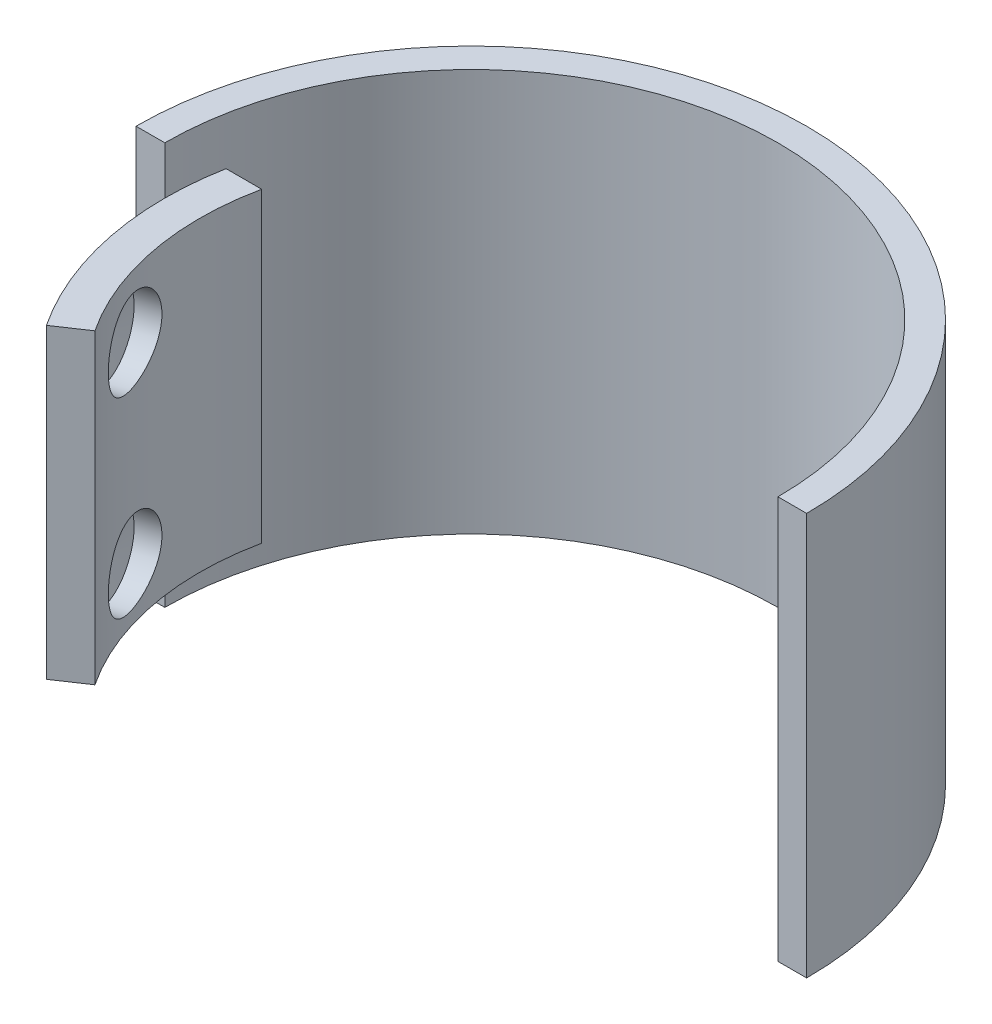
from build123d import *

# Parameters (mm, degrees)
BOSS_EXTRU_1_DEPTH              = 42
D_GAGEMENT_M102_D               = 8.5
D_GAGEMENT_M102_DEPTH           = 2
D_GAGEMENT_M102_TIP             = 0.559523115
D_GAGEMENT_M102_ON_FACE_2_D     = 8.5
D_GAGEMENT_M102_ON_FACE_2_DEPTH = 2
D_GAGEMENT_M102_ON_FACE_2_TIP   = 0.559523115
ENL_V_START                     = -5
ENL_V_MAT_EXTRU_1_DEPTH         = 5
ENL_V_MAT_EXTRU_2_DEPTH         = 5
D_GAGEMENT_M103_D               = 8.5
D_GAGEMENT_M103_DEPTH           = 2
D_GAGEMENT_M103_TIP             = 0.559523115
D_GAGEMENT_M103_ON_FACE_2_D     = 8.5
D_GAGEMENT_M103_ON_FACE_2_DEPTH = 2
D_GAGEMENT_M103_ON_FACE_2_TIP   = 0.559523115


with BuildPart() as part:
    # Esquisse1 → Boss.-Extru.1 (new body)
    with BuildSketch(Plane(origin=(0, 0, 0), x_dir=(1, 0, 0), z_dir=(0, 1, 0))):
        with BuildLine():
            Line((-35, 0), (-32, 0))
            ThreePointArc((-32, 0), (-31.462175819, -5.842216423), (-29.866781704, -11.488052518))
            ThreePointArc((-29.866781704, -11.488052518), (-28.439475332, -14.669568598), (-26.674471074, -17.676894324))
            Line((-26.674471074, -17.676894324), (-23.648884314, -15.645373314))
            ThreePointArc((-23.648884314, -15.645373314), (-27.855155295, -5.304503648), (-27.743913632, 5.858557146))
            Line((-27.743913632, 5.858557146), (-31.459137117, 5.858557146))
            ThreePointArc((-31.459137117, 5.858557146), (2.941735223, 31.864497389), (32, 0))
            Line((32, 0), (35, 0))
            ThreePointArc((35, 0), (0, 35), (-35, 0))
        make_face()
    extrude(amount=BOSS_EXTRU_1_DEPTH)

    # D_gagement M102
    with Locations(Plane(origin=(-27.077579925, 30.644072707, 8.417368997), x_dir=(0.296848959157, 0, 0.954924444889), z_dir=(0.954924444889, 0, -0.296848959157))):
        with Locations((0, 0)):
            Hole(D_GAGEMENT_M102_D / 2, depth=D_GAGEMENT_M102_DEPTH)
            with Locations((0, 0, -(D_GAGEMENT_M102_DEPTH + D_GAGEMENT_M102_TIP / 2))):  # 165° drill point
                Cone(0, D_GAGEMENT_M102_D / 2, D_GAGEMENT_M102_TIP, mode=Mode.SUBTRACT)

    # D_gagement M102 on face 2
    with Locations(Plane(origin=(-27.077579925, 10.644072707, 8.417368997), x_dir=(0.296849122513, 0, 0.954924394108), z_dir=(0.954924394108, 0, -0.296849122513))):
        with Locations((0, 0)):
            Hole(D_GAGEMENT_M102_ON_FACE_2_D / 2, depth=D_GAGEMENT_M102_ON_FACE_2_DEPTH)
            with Locations((0, 0, -(D_GAGEMENT_M102_ON_FACE_2_DEPTH + D_GAGEMENT_M102_ON_FACE_2_TIP / 2))):  # 165° drill point
                Cone(0, D_GAGEMENT_M102_ON_FACE_2_D / 2, D_GAGEMENT_M102_ON_FACE_2_TIP, mode=Mode.SUBTRACT)

    # Esquisse5 → Enl_v. mat.-Extru.1 (cut)
    with BuildSketch(Plane(origin=(0, 42, 0), x_dir=(1, 0, 0), z_dir=(0, 1, 0)).offset(ENL_V_START)):
        with BuildLine():
            Line((-25.791907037, 7.208066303), (-30.861449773, 8.459959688))
            ThreePointArc((-30.861449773, 8.459959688), (-31.466008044, -5.821540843), (-25.791907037, -18.941423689))
            Line((-25.791907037, -18.941423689), (-21.15404883, -16.422085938))
            ThreePointArc((-21.15404883, -16.422085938), (-26.278826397, -5.157709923), (-25.791907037, 7.208066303))
        make_face()
    extrude(amount=ENL_V_MAT_EXTRU_1_DEPTH, mode=Mode.SUBTRACT)

    # Esquisse6 → Enl_v. mat.-Extru.2 (cut)
    with BuildSketch(Plane.XZ):
        with BuildLine():
            Line((-24.27773602, 20.846859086), (-20.042037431, 17.938373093))
            ThreePointArc((-20.042037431, 17.938373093), (-26.372237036, 5.289008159), (-25.40909795, -8.823051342))
            Line((-25.40909795, -8.823051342), (-30.261604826, -10.403618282))
            ThreePointArc((-30.261604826, -10.403618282), (-31.429015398, 6.018055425), (-24.27773602, 20.846859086))
        make_face()
    extrude(amount=-ENL_V_MAT_EXTRU_2_DEPTH, mode=Mode.SUBTRACT)

    # D_gagement M103
    with Locations(Plane(origin=(30.4375, 30.44192575, -9.877175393), x_dir=(-0.308661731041, 0, -0.951171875), z_dir=(-0.951171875, 0, 0.308661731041))):
        with Locations((0, 0)):
            Hole(D_GAGEMENT_M103_D / 2, depth=D_GAGEMENT_M103_DEPTH)
            with Locations((0, 0, -(D_GAGEMENT_M103_DEPTH + D_GAGEMENT_M103_TIP / 2))):  # 165° drill point
                Cone(0, D_GAGEMENT_M103_D / 2, D_GAGEMENT_M103_TIP, mode=Mode.SUBTRACT)

    # D_gagement M103 on face 2
    with Locations(Plane(origin=(30.4375, 10.44192575, -9.877175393), x_dir=(-0.308661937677, 0, -0.951171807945), z_dir=(-0.951171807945, 0, 0.308661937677))):
        with Locations((0, 0)):
            Hole(D_GAGEMENT_M103_ON_FACE_2_D / 2, depth=D_GAGEMENT_M103_ON_FACE_2_DEPTH)
            with Locations((0, 0, -(D_GAGEMENT_M103_ON_FACE_2_DEPTH + D_GAGEMENT_M103_ON_FACE_2_TIP / 2))):  # 165° drill point
                Cone(0, D_GAGEMENT_M103_ON_FACE_2_D / 2, D_GAGEMENT_M103_ON_FACE_2_TIP, mode=Mode.SUBTRACT)


solid = part.part
